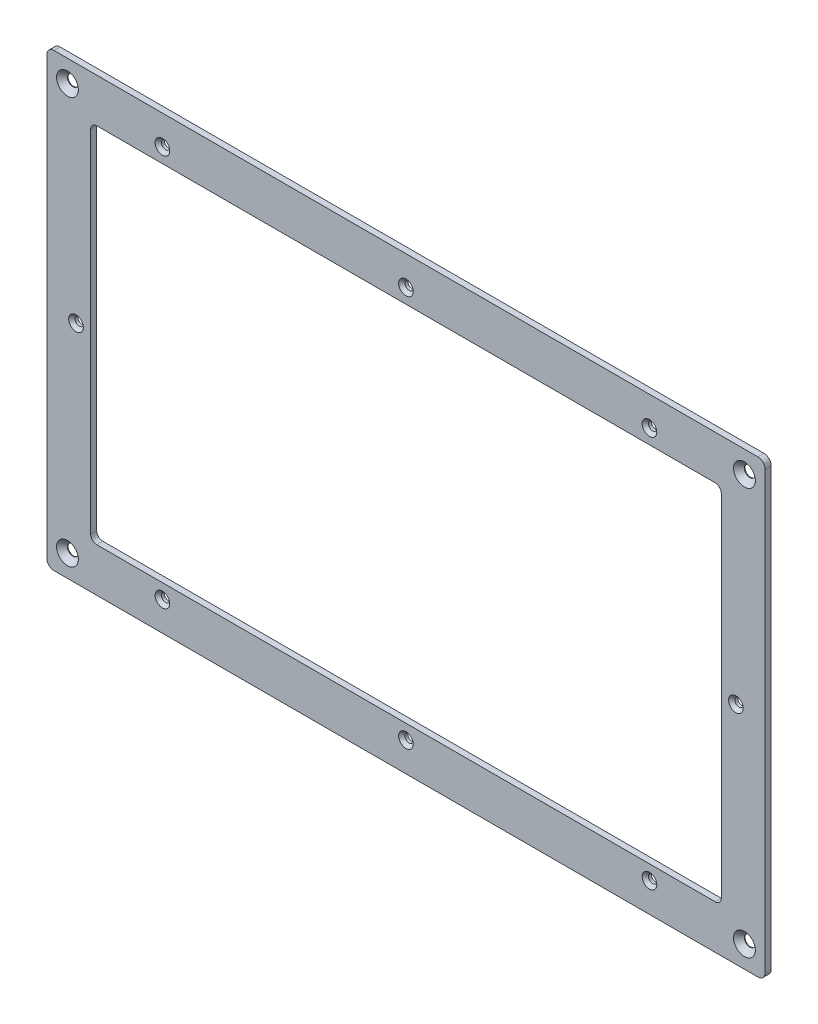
from build123d import *

# Parameters (mm, degrees)
EXTRUDE1_DEPTH                   = 1.25
CUT_EXTRUDE4_DEPTH               = 175.122801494
FURO_COM_FOLGA_DE_M31_AT_2_COUNT = 2
FURO_COM_FOLGA_DE_M31_AT_2_PITCH = 100
FURO_COM_FOLGA_DE_M31_AT_3_COUNT = 2
FURO_COM_FOLGA_DE_M31_AT_3_PITCH = 100
FURO_COM_FOLGA_DE_M31_AT_4_COUNT = 2
FURO_COM_FOLGA_DE_M31_AT_4_PITCH = 157.608692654
FURO_COM_FOLGA_DE_M31_AT_5_COUNT = 2
FURO_COM_FOLGA_DE_M31_AT_5_PITCH = 157.608692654


with BuildPart() as part:
    # Sketch1 → Extrude1 (new, symmetric)
    with BuildSketch(Plane.XY):
        with BuildLine():
            Line((-144.5, 92.5), (144.5, 92.5))
            ThreePointArc((144.5, 92.5), (146.621320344, 91.621320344), (147.5, 89.5))
            Line((147.5, 89.5), (147.5, -89.5))
            ThreePointArc((147.5, -89.5), (146.621320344, -91.621320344), (144.5, -92.5))
            Line((144.5, -92.5), (-144.5, -92.5))
            ThreePointArc((-144.5, -92.5), (-146.621320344, -91.621320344), (-147.5, -89.5))
            Line((-147.5, -89.5), (-147.5, 89.5))
            ThreePointArc((-147.5, 89.5), (-146.621320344, 91.621320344), (-144.5, 92.5))
        make_face()
    extrude(amount=EXTRUDE1_DEPTH, both=True)

    # Sketch5 → Cut-Extrude4 (cut, through all)
    with BuildSketch(Plane.XY.offset(1.25)):
        with BuildLine():
            Line((-127, 74.5), (127, 74.5))
            ThreePointArc((127, 74.5), (128.767766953, 73.767766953), (129.5, 72))
            Line((129.5, 72), (129.5, -72))
            ThreePointArc((129.5, -72), (128.767766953, -73.767766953), (127, -74.5))
            Line((127, -74.5), (-127, -74.5))
            ThreePointArc((-127, -74.5), (-128.767766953, -73.767766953), (-129.5, -72))
            Line((-129.5, -72), (-129.5, 72))
            ThreePointArc((-129.5, 72), (-128.767766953, 73.767766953), (-127, 74.5))
        make_face()
    extrude(amount=-CUT_EXTRUDE4_DEPTH, mode=Mode.SUBTRACT)

    # Esbo_o1 → Escareado para SFHCS M41 (revolve, cut)
    with BuildSketch(Plane(origin=(139, 83.5, 1.25), x_dir=(0, -1, 0), z_dir=(1, 0, 0))):
        Polygon((0, 0), (0, 2.5), (2.25, 2.5), (2.25, 2.23), (4.48, 0), align=None)
    escareado_para_sfhcs_m41 = revolve(axis=Axis((139, 83.5, 7.6), (0, 0, -1)), mode=Mode.SUBTRACT)

    # Esbo_o3 → Furo com folga de M31 (revolve, cut)
    with BuildSketch(Plane(origin=(0, -80.5, 1.25), x_dir=(0, -1, 0), z_dir=(1, 0, 0))):
        Polygon((0, 0), (0, 2.5), (1.7, 2.5), (1.7, 1.3), (3, 0), align=None)
    furo_com_folga_de_m31 = revolve(axis=Axis((0, -80.5, 7.6), (0, 0, -1)), mode=Mode.SUBTRACT)

    # Furo com folga de M31 at 2: Furo com folga de M31 ×2
    with Locations(*[(-i * FURO_COM_FOLGA_DE_M31_AT_2_PITCH, 0, 0) for i in range(1, FURO_COM_FOLGA_DE_M31_AT_2_COUNT)]):
        add(furo_com_folga_de_m31, mode=Mode.SUBTRACT)

    # Furo com folga de M31 at 3: Furo com folga de M31 ×2
    with Locations(*[(i * FURO_COM_FOLGA_DE_M31_AT_3_PITCH, 0, 0) for i in range(1, FURO_COM_FOLGA_DE_M31_AT_3_COUNT)]):
        add(furo_com_folga_de_m31, mode=Mode.SUBTRACT)

    # Furo com folga de M31 at 4: Furo com folga de M31 ×2
    with Locations(*[Vector(-0.859724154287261, 0.5107586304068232, 0) * (i * FURO_COM_FOLGA_DE_M31_AT_4_PITCH) for i in range(1, FURO_COM_FOLGA_DE_M31_AT_4_COUNT)]):
        add(furo_com_folga_de_m31, mode=Mode.SUBTRACT)

    # Furo com folga de M31 at 5: Furo com folga de M31 ×2
    with Locations(*[Vector(0.8597241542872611, 0.5107586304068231, 0) * (i * FURO_COM_FOLGA_DE_M31_AT_5_PITCH) for i in range(1, FURO_COM_FOLGA_DE_M31_AT_5_COUNT)]):
        add(furo_com_folga_de_m31, mode=Mode.SUBTRACT)

    # Espelhar1: Furo com folga de M31 across plane
    add(furo_com_folga_de_m31.mirror(Plane.ZX), mode=Mode.SUBTRACT)

    # Espelhar1 copy 1 sketch → Espelhar1 copy 1 (revolve, cut)
    with BuildSketch(Plane(origin=(-100, 80.5, 1.25), x_dir=(0, 1, 0), z_dir=(1, 0, 0))):
        Polygon((0, 0), (0, -2.5), (1.7, -2.5), (1.7, -1.3), (3, 0), align=None)
    revolve(axis=Axis((-100, 80.5, 7.6), (0, 0, 1)), mode=Mode.SUBTRACT)

    # Espelhar1 copy 2 sketch → Espelhar1 copy 2 (revolve, cut)
    with BuildSketch(Plane(origin=(100, 80.5, 1.25), x_dir=(0, 1, 0), z_dir=(1, 0, 0))):
        Polygon((0, 0), (0, -2.5), (1.7, -2.5), (1.7, -1.3), (3, 0), align=None)
    revolve(axis=Axis((100, 80.5, 7.6), (0, 0, 1)), mode=Mode.SUBTRACT)

    # Espelhar1 copy 3 sketch → Espelhar1 copy 3 (revolve, cut)
    with BuildSketch(Plane(origin=(-135.5, 0, 1.25), x_dir=(0, 1, 0), z_dir=(1, 0, 0))):
        Polygon((0, 0), (0, -2.5), (1.7, -2.5), (1.7, -1.3), (3, 0), align=None)
    revolve(axis=Axis((-135.5, 0, 7.6), (0, 0, 1)), mode=Mode.SUBTRACT)

    # Espelhar1 copy 4 sketch → Espelhar1 copy 4 (revolve, cut)
    with BuildSketch(Plane(origin=(135.5, 0, 1.25), x_dir=(0, 1, 0), z_dir=(1, 0, 0))):
        Polygon((0, 0), (0, -2.5), (1.7, -2.5), (1.7, -1.3), (3, 0), align=None)
    revolve(axis=Axis((135.5, 0, 7.6), (0, 0, 1)), mode=Mode.SUBTRACT)

    # Espelhar2: Escareado para SFHCS M41 across plane
    add(escareado_para_sfhcs_m41.mirror(Plane(origin=(0, 0, 0), x_dir=(0, 0, 1), z_dir=(1, 0, 0))), mode=Mode.SUBTRACT)

    # Espelhar3: Escareado para SFHCS M41 across plane
    add(escareado_para_sfhcs_m41.mirror(Plane.ZX), mode=Mode.SUBTRACT)

    # Espelhar3 copy 1 sketch → Espelhar3 copy 1 (revolve, cut)
    with BuildSketch(Plane(origin=(-139, -83.5, 1.25), x_dir=(0, 1, 0), z_dir=(-1, 0, 0))):
        Polygon((0, 0), (0, 2.5), (2.25, 2.5), (2.25, 2.23), (4.48, 0), align=None)
    revolve(axis=Axis((-139, -83.5, 7.6), (0, 0, -1)), mode=Mode.SUBTRACT)


solid = part.part
